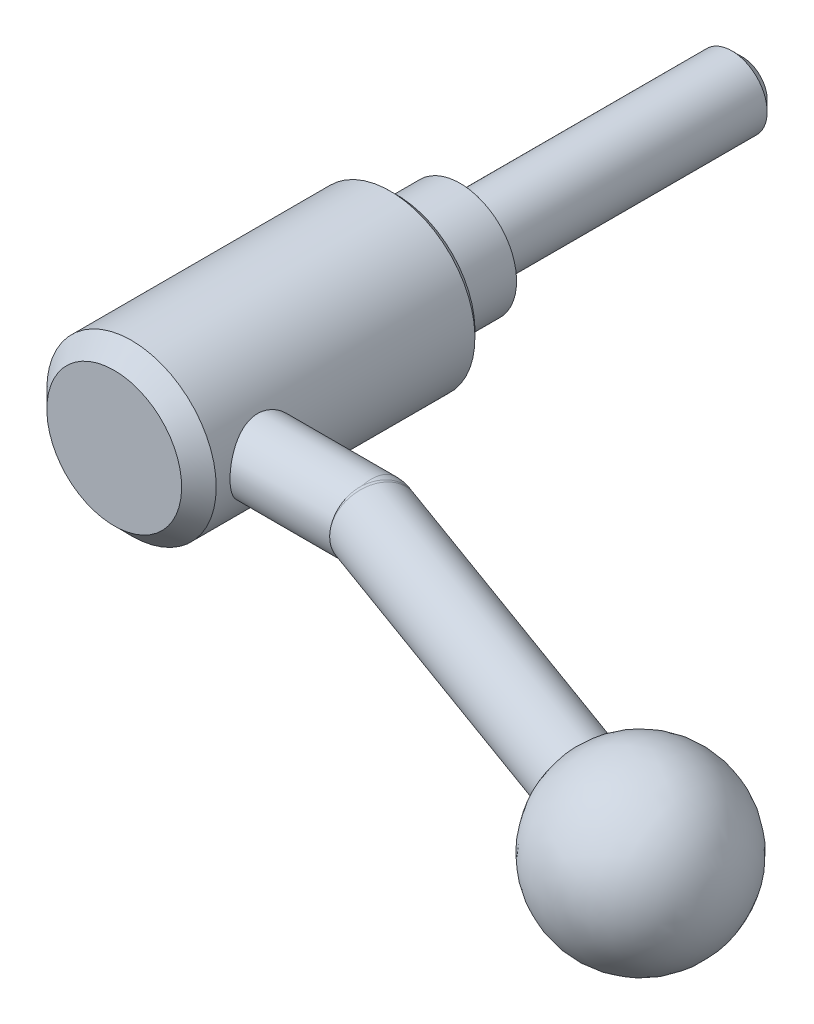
ISO-10303-21;
HEADER;
FILE_DESCRIPTION(('STEP AP214'),'2;1');
FILE_NAME('part.step','',(''),(''),'','','');
FILE_SCHEMA(('AUTOMOTIVE_DESIGN { 1 0 10303 214 1 1 1 1 }'));
ENDSEC;
DATA;
#1=APPLICATION_CONTEXT('core data for automotive mechanical design processes');
#2=APPLICATION_PROTOCOL_DEFINITION('international standard','automotive_design',2000,#1);
#3=PRODUCT_CONTEXT('',#1,'mechanical');
#4=PRODUCT('Part','Part','',(#3));
#5=PRODUCT_RELATED_PRODUCT_CATEGORY('part','',(#4));
#6=PRODUCT_DEFINITION_FORMATION('','',#4);
#7=PRODUCT_DEFINITION_CONTEXT('part definition',#1,'design');
#8=PRODUCT_DEFINITION('design','',#6,#7);
#9=PRODUCT_DEFINITION_SHAPE('','',#8);
#10=(LENGTH_UNIT() NAMED_UNIT(*) SI_UNIT(.MILLI.,.METRE.));
#11=(NAMED_UNIT(*) PLANE_ANGLE_UNIT() SI_UNIT($,.RADIAN.));
#12=(NAMED_UNIT(*) SI_UNIT($,.STERADIAN.) SOLID_ANGLE_UNIT());
#13=UNCERTAINTY_MEASURE_WITH_UNIT(LENGTH_MEASURE(1.E-05),#10,'distance_accuracy_value','');
#14=(GEOMETRIC_REPRESENTATION_CONTEXT(3) GLOBAL_UNCERTAINTY_ASSIGNED_CONTEXT((#13)) GLOBAL_UNIT_ASSIGNED_CONTEXT((#10,
#11,#12)) REPRESENTATION_CONTEXT('',''));
#15=CARTESIAN_POINT('',(0.,0.,0.));
#16=DIRECTION('',(0.,0.,1.));
#17=DIRECTION('',(1.,0.,0.));
#18=AXIS2_PLACEMENT_3D('',#15,#16,#17);
#19=CARTESIAN_POINT('',(6.,0.,0.));
#20=DIRECTION('',(0.,0.,-1.));
#21=DIRECTION('',(0.,1.,0.));
#22=AXIS2_PLACEMENT_3D('',#19,#20,#21);
#23=PLANE('',#22);
#24=CARTESIAN_POINT('',(0.,0.,0.));
#25=DIRECTION('',(0.,0.,1.));
#26=DIRECTION('',(0.,-1.,0.));
#27=AXIS2_PLACEMENT_3D('',#24,#25,#26);
#28=CIRCLE('',#27,8.);
#29=CARTESIAN_POINT('',(0.,-8.,0.));
#30=VERTEX_POINT('',#29);
#31=EDGE_CURVE('E244',#30,#30,#28,.T.);
#32=ORIENTED_EDGE('',*,*,#31,.F.);
#33=EDGE_LOOP('',(#32));
#34=FACE_BOUND('',#33,.T.);
#35=CARTESIAN_POINT('',(0.,0.,0.));
#36=DIRECTION('',(0.,0.,-1.));
#37=DIRECTION('',(-1.,0.,0.));
#38=AXIS2_PLACEMENT_3D('',#35,#36,#37);
#39=CIRCLE('',#38,5.);
#40=CARTESIAN_POINT('',(-5.,0.,0.));
#41=VERTEX_POINT('',#40);
#42=EDGE_CURVE('E248',#41,#41,#39,.T.);
#43=ORIENTED_EDGE('',*,*,#42,.F.);
#44=EDGE_LOOP('',(#43));
#45=FACE_BOUND('',#44,.T.);
#46=ADVANCED_FACE('F14',(#34,#45),#23,.T.);
#47=CARTESIAN_POINT('',(0.,0.,4.5));
#48=DIRECTION('',(0.,0.,1.));
#49=DIRECTION('',(0.,-1.,0.));
#50=AXIS2_PLACEMENT_3D('',#47,#48,#49);
#51=CYLINDRICAL_SURFACE('',#50,8.);
#52=CARTESIAN_POINT('',(0.,0.,9.));
#53=DIRECTION('',(0.,0.,1.));
#54=DIRECTION('',(0.,-1.,0.));
#55=AXIS2_PLACEMENT_3D('',#52,#53,#54);
#56=CIRCLE('',#55,8.);
#57=CARTESIAN_POINT('',(0.,-8.,9.));
#58=VERTEX_POINT('',#57);
#59=EDGE_CURVE('E247',#58,#58,#56,.T.);
#60=ORIENTED_EDGE('',*,*,#59,.F.);
#61=EDGE_LOOP('',(#60));
#62=FACE_BOUND('',#61,.T.);
#63=ORIENTED_EDGE('',*,*,#31,.T.);
#64=EDGE_LOOP('',(#63));
#65=FACE_BOUND('',#64,.T.);
#66=ADVANCED_FACE('F103',(#62,#65),#51,.T.);
#67=CARTESIAN_POINT('',(9.55,0.,9.));
#68=DIRECTION('',(0.,0.,-1.));
#69=DIRECTION('',(0.,1.,0.));
#70=AXIS2_PLACEMENT_3D('',#67,#68,#69);
#71=PLANE('',#70);
#72=ORIENTED_EDGE('',*,*,#59,.T.);
#73=EDGE_LOOP('',(#72));
#74=FACE_BOUND('',#73,.T.);
#75=CARTESIAN_POINT('',(0.,0.,9.));
#76=DIRECTION('',(0.,0.,1.));
#77=DIRECTION('',(0.,-1.,0.));
#78=AXIS2_PLACEMENT_3D('',#75,#76,#77);
#79=CIRCLE('',#78,11.1);
#80=CARTESIAN_POINT('',(0.,-11.1,9.));
#81=VERTEX_POINT('',#80);
#82=EDGE_CURVE('E251',#81,#81,#79,.T.);
#83=ORIENTED_EDGE('',*,*,#82,.F.);
#84=EDGE_LOOP('',(#83));
#85=FACE_BOUND('',#84,.T.);
#86=ADVANCED_FACE('F113',(#74,#85),#71,.T.);
#87=CARTESIAN_POINT('',(4.775,0.,49.));
#88=DIRECTION('',(0.,0.,1.));
#89=DIRECTION('',(0.,-1.,0.));
#90=AXIS2_PLACEMENT_3D('',#87,#88,#89);
#91=PLANE('',#90);
#92=CARTESIAN_POINT('',(0.,0.,49.));
#93=DIRECTION('',(0.,0.,-1.));
#94=DIRECTION('',(0.,1.,0.));
#95=AXIS2_PLACEMENT_3D('',#92,#93,#94);
#96=CIRCLE('',#95,9.55);
#97=CARTESIAN_POINT('',(0.,9.55,49.));
#98=VERTEX_POINT('',#97);
#99=EDGE_CURVE('E253',#98,#98,#96,.T.);
#100=ORIENTED_EDGE('',*,*,#99,.F.);
#101=EDGE_LOOP('',(#100));
#102=FACE_BOUND('',#101,.T.);
#103=ADVANCED_FACE('F122',(#102),#91,.T.);
#104=CARTESIAN_POINT('',(0.,0.,9.9));
#105=DIRECTION('',(0.,0.,1.));
#106=DIRECTION('',(0.,-1.,0.));
#107=AXIS2_PLACEMENT_3D('',#104,#105,#106);
#108=CONICAL_SURFACE('',#107,12.,0.785398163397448);
#109=ORIENTED_EDGE('',*,*,#82,.T.);
#110=EDGE_LOOP('',(#109));
#111=FACE_BOUND('',#110,.T.);
#112=CARTESIAN_POINT('',(0.,0.,9.9));
#113=DIRECTION('',(0.,0.,1.));
#114=DIRECTION('',(0.,-1.,0.));
#115=AXIS2_PLACEMENT_3D('',#112,#113,#114);
#116=CIRCLE('',#115,12.);
#117=CARTESIAN_POINT('',(0.,-12.,9.9));
#118=VERTEX_POINT('',#117);
#119=EDGE_CURVE('E255',#118,#118,#116,.T.);
#120=ORIENTED_EDGE('',*,*,#119,.F.);
#121=EDGE_LOOP('',(#120));
#122=FACE_BOUND('',#121,.T.);
#123=ADVANCED_FACE('F126',(#111,#122),#108,.T.);
#124=CARTESIAN_POINT('',(0.,0.,46.55));
#125=DIRECTION('',(0.,0.,-1.));
#126=DIRECTION('',(0.,1.,0.));
#127=AXIS2_PLACEMENT_3D('',#124,#125,#126);
#128=CONICAL_SURFACE('',#127,12.,0.785398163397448);
#129=CARTESIAN_POINT('',(0.,0.,46.55));
#130=DIRECTION('',(0.,0.,1.));
#131=DIRECTION('',(0.,-1.,0.));
#132=AXIS2_PLACEMENT_3D('',#129,#130,#131);
#133=CIRCLE('',#132,12.);
#134=CARTESIAN_POINT('',(0.,-12.,46.55));
#135=VERTEX_POINT('',#134);
#136=EDGE_CURVE('E47',#135,#135,#133,.F.);
#137=ORIENTED_EDGE('',*,*,#136,.F.);
#138=EDGE_LOOP('',(#137));
#139=FACE_BOUND('',#138,.T.);
#140=ORIENTED_EDGE('',*,*,#99,.T.);
#141=EDGE_LOOP('',(#140));
#142=FACE_BOUND('',#141,.T.);
#143=ADVANCED_FACE('F130',(#139,#142),#128,.T.);
#144=CARTESIAN_POINT('',(0.,0.,28.225));
#145=DIRECTION('',(0.,0.,1.));
#146=DIRECTION('',(0.,-1.,0.));
#147=AXIS2_PLACEMENT_3D('',#144,#145,#146);
#148=CYLINDRICAL_SURFACE('',#147,12.);
#149=ORIENTED_EDGE('',*,*,#119,.T.);
#150=EDGE_LOOP('',(#149));
#151=FACE_BOUND('',#150,.T.);
#152=ORIENTED_EDGE('',*,*,#136,.T.);
#153=EDGE_LOOP('',(#152));
#154=FACE_BOUND('',#153,.T.);
#155=CARTESIAN_POINT('',(10.9087121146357,-5.,39.6));
#156=CARTESIAN_POINT('',(10.9087074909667,-5.00000435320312,39.4663888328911));
#157=CARTESIAN_POINT('',(10.9111719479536,-4.9946421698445,39.332819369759));
#158=CARTESIAN_POINT('',(10.9209330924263,-4.97326581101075,39.0666742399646));
#159=CARTESIAN_POINT('',(10.9282304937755,-4.95725006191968,38.9340987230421));
#160=CARTESIAN_POINT('',(10.9474176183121,-4.91473148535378,38.6709152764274));
#161=CARTESIAN_POINT('',(10.9593097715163,-4.88822310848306,38.5403084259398));
#162=CARTESIAN_POINT('',(10.9872938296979,-4.82499419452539,38.2820015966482));
#163=CARTESIAN_POINT('',(11.0033874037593,-4.78826959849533,38.1543027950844));
#164=CARTESIAN_POINT('',(11.0391954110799,-4.7051251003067,37.9031731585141));
#165=CARTESIAN_POINT('',(11.0588958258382,-4.65874264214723,37.7797279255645));
#166=CARTESIAN_POINT('',(11.1013704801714,-4.55660310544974,37.5373089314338));
#167=CARTESIAN_POINT('',(11.1241458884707,-4.50084246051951,37.4183368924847));
#168=CARTESIAN_POINT('',(11.1961251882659,-4.32013829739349,37.0691963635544));
#169=CARTESIAN_POINT('',(11.2490137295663,-4.18170265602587,36.8465940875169));
#170=CARTESIAN_POINT('',(11.362232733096,-3.8638933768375,36.4146674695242));
#171=CARTESIAN_POINT('',(11.4228143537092,-3.68265681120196,36.2067915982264));
#172=CARTESIAN_POINT('',(11.5425745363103,-3.28806144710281,35.8231953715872));
#173=CARTESIAN_POINT('',(11.6017524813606,-3.07468881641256,35.6474889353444));
#174=CARTESIAN_POINT('',(11.6861286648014,-2.729351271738,35.4081642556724));
#175=CARTESIAN_POINT('',(11.7140590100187,-2.60716588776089,35.3310867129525));
#176=CARTESIAN_POINT('',(11.7671168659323,-2.35613739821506,35.1875758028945));
#177=CARTESIAN_POINT('',(11.7922454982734,-2.22729698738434,35.1211381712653));
#178=CARTESIAN_POINT('',(11.8389586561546,-1.96390692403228,34.9995551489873));
#179=CARTESIAN_POINT('',(11.8605461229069,-1.82936212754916,34.9444003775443));
#180=CARTESIAN_POINT('',(11.8995627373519,-1.55549044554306,34.8458826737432));
#181=CARTESIAN_POINT('',(11.9169929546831,-1.41616480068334,34.802516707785));
#182=CARTESIAN_POINT('',(11.9541941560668,-1.06793180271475,34.7106955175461));
#183=CARTESIAN_POINT('',(11.971276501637,-0.856830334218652,34.6692715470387));
#184=CARTESIAN_POINT('',(11.9941758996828,-0.430450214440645,34.6139291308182));
#185=CARTESIAN_POINT('',(11.9999946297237,-0.21517219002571,34.6000065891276));
#186=CARTESIAN_POINT('',(12.0000033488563,0.134179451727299,34.599995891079));
#187=CARTESIAN_POINT('',(11.9977460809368,0.268317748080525,34.6054032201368));
#188=CARTESIAN_POINT('',(11.9887853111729,0.535617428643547,34.6269647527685));
#189=CARTESIAN_POINT('',(11.9820811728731,0.668778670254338,34.6431204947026));
#190=CARTESIAN_POINT('',(11.9643973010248,0.933147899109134,34.6860218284));
#191=CARTESIAN_POINT('',(11.953415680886,1.06435499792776,34.7127720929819));
#192=CARTESIAN_POINT('',(11.9274624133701,1.32387896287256,34.7765977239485));
#193=CARTESIAN_POINT('',(11.9124892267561,1.45219469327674,34.8136770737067));
#194=CARTESIAN_POINT('',(11.8789883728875,1.70463818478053,34.8976767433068));
#195=CARTESIAN_POINT('',(11.8604718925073,1.82877771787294,34.9445661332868));
#196=CARTESIAN_POINT('',(11.8203169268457,2.07253499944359,35.0478413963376));
#197=CARTESIAN_POINT('',(11.798677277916,2.19215104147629,35.1042308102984));
#198=CARTESIAN_POINT('',(11.7298504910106,2.54307722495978,35.2869746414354));
#199=CARTESIAN_POINT('',(11.6787242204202,2.76669061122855,35.4269801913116));
#200=CARTESIAN_POINT('',(11.5683077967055,3.19783916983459,35.7465298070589));
#201=CARTESIAN_POINT('',(11.5087513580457,3.40417283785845,35.9275881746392));
#202=CARTESIAN_POINT('',(11.3892960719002,3.78466739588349,36.3211115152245));
#203=CARTESIAN_POINT('',(11.3293970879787,3.95881438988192,36.5335899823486));
#204=CARTESIAN_POINT('',(11.2426695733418,4.19642658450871,36.8777228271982));
#205=CARTESIAN_POINT('',(11.2136418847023,4.27318612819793,36.999855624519));
#206=CARTESIAN_POINT('',(11.1581434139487,4.41607290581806,37.2507224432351));
#207=CARTESIAN_POINT('',(11.1316715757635,4.48220453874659,37.3794537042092));
#208=CARTESIAN_POINT('',(11.0821579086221,4.60326626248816,37.6427214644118));
#209=CARTESIAN_POINT('',(11.0591162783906,4.65819570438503,37.7772582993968));
#210=CARTESIAN_POINT('',(11.017290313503,4.75627570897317,38.0511355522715));
#211=CARTESIAN_POINT('',(10.9985037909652,4.7994323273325,38.1904734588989));
#212=CARTESIAN_POINT('',(10.9666619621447,4.87173601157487,38.4661918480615));
#213=CARTESIAN_POINT('',(10.95337593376,4.90145335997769,38.6023961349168));
#214=CARTESIAN_POINT('',(10.9317788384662,4.94943495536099,38.8771389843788));
#215=CARTESIAN_POINT('',(10.9234654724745,4.96770449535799,39.0156764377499));
#216=CARTESIAN_POINT('',(10.9121183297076,4.99258064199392,39.2939753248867));
#217=CARTESIAN_POINT('',(10.9090831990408,4.9991902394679,39.4337364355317));
#218=CARTESIAN_POINT('',(10.9084052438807,5.00066966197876,39.7133300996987));
#219=CARTESIAN_POINT('',(10.9107621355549,4.99554010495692,39.8531626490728));
#220=CARTESIAN_POINT('',(10.9203897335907,4.97445537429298,40.1209853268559));
#221=CARTESIAN_POINT('',(10.9272683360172,4.9593636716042,40.249058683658));
#222=CARTESIAN_POINT('',(10.9453203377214,4.91939458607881,40.5034023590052));
#223=CARTESIAN_POINT('',(10.956495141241,4.89451400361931,40.6296720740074));
#224=CARTESIAN_POINT('',(10.9827914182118,4.83521904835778,40.879504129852));
#225=CARTESIAN_POINT('',(10.9979119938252,4.80080684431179,41.003067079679));
#226=CARTESIAN_POINT('',(11.0316484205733,4.72276748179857,41.2467742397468));
#227=CARTESIAN_POINT('',(11.0502656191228,4.67913677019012,41.366917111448));
#228=CARTESIAN_POINT('',(11.1114356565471,4.5329201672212,41.7260913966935));
#229=CARTESIAN_POINT('',(11.1587373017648,4.41622884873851,41.9587504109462));
#230=CARTESIAN_POINT('',(11.2607390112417,4.14922979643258,42.4019586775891));
#231=CARTESIAN_POINT('',(11.3154417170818,3.99891004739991,42.6124999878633));
#232=CARTESIAN_POINT('',(11.4317082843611,3.65402282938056,43.0243539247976));
#233=CARTESIAN_POINT('',(11.4934615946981,3.45679190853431,43.223388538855));
#234=CARTESIAN_POINT('',(11.6130178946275,3.03093539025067,43.586433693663));
#235=CARTESIAN_POINT('',(11.6708188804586,2.80229404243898,43.7504265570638));
#236=CARTESIAN_POINT('',(11.7505844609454,2.43719005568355,43.9681695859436));
#237=CARTESIAN_POINT('',(11.7762816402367,2.31013401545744,44.0366869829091));
#238=CARTESIAN_POINT('',(11.8243239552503,2.05007418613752,44.1626787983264));
#239=CARTESIAN_POINT('',(11.8466705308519,1.91707298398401,44.2201579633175));
#240=CARTESIAN_POINT('',(11.8873291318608,1.64624850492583,44.3234355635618));
#241=CARTESIAN_POINT('',(11.9056471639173,1.50843276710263,44.3692514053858));
#242=CARTESIAN_POINT('',(11.9377378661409,1.228899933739,44.4488050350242));
#243=CARTESIAN_POINT('',(11.9515124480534,1.08718450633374,44.4825479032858));
#244=CARTESIAN_POINT('',(11.9750487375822,0.788932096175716,44.5398925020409));
#245=CARTESIAN_POINT('',(11.9843764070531,0.63214971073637,44.5624048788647));
#246=CARTESIAN_POINT('',(11.9968515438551,0.316905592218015,44.5924579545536));
#247=CARTESIAN_POINT('',(11.9999991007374,0.158443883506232,44.5999988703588));
#248=CARTESIAN_POINT('',(12.0000007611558,-0.134110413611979,44.6000009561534));
#249=CARTESIAN_POINT('',(11.9977471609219,-0.268208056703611,44.5946001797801));
#250=CARTESIAN_POINT('',(11.9887940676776,-0.535433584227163,44.5730555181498));
#251=CARTESIAN_POINT('',(11.9820932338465,-0.668561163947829,44.5569083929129));
#252=CARTESIAN_POINT('',(11.9644136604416,-0.932940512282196,44.5140182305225));
#253=CARTESIAN_POINT('',(11.9534307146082,-1.06419030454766,44.4872647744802));
#254=CARTESIAN_POINT('',(11.9274719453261,-1.32379800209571,44.4234258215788));
#255=CARTESIAN_POINT('',(11.9124945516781,-1.45215474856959,44.3863362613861));
#256=CARTESIAN_POINT('',(11.8789871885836,-1.70464692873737,44.3023203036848));
#257=CARTESIAN_POINT('',(11.8604692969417,-1.82879507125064,44.2554272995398));
#258=CARTESIAN_POINT('',(11.8203109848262,-2.07256946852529,44.1521432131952));
#259=CARTESIAN_POINT('',(11.798669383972,-2.19219399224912,44.0957485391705));
#260=CARTESIAN_POINT('',(11.7298430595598,-2.5431097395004,43.9130050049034));
#261=CARTESIAN_POINT('',(11.678720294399,-2.76670593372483,43.7730084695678));
#262=CARTESIAN_POINT('',(11.5683124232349,-3.19782111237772,43.4534835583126));
#263=CARTESIAN_POINT('',(11.5087611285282,-3.40413902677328,43.2724414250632));
#264=CARTESIAN_POINT('',(11.3893058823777,-3.78463884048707,42.8789233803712));
#265=CARTESIAN_POINT('',(11.3294017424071,-3.95880157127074,42.6664288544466));
#266=CARTESIAN_POINT('',(11.2426570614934,-4.19646089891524,42.3222273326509));
#267=CARTESIAN_POINT('',(11.2136175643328,-4.27325053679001,42.2000414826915));
#268=CARTESIAN_POINT('',(11.1580975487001,-4.41618919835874,41.9490631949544));
#269=CARTESIAN_POINT('',(11.1316160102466,-4.48234247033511,41.8202734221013));
#270=CARTESIAN_POINT('',(11.0821110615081,-4.60337872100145,41.557006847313));
#271=CARTESIAN_POINT('',(11.059084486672,-4.65827203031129,41.4225353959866));
#272=CARTESIAN_POINT('',(11.0172786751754,-4.75630122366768,41.1487863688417));
#273=CARTESIAN_POINT('',(10.9984982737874,-4.79944033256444,41.0095101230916));
#274=CARTESIAN_POINT('',(10.9584249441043,-4.89044651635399,40.6624381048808));
#275=CARTESIAN_POINT('',(10.9399177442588,-4.93143703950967,40.4524635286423));
#276=CARTESIAN_POINT('',(10.9150663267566,-4.98620740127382,40.028289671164));
#277=CARTESIAN_POINT('',(10.9087195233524,-4.9999930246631,39.8140912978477));
#278=CARTESIAN_POINT('',(10.9087121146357,-5.,39.6));
#279=B_SPLINE_CURVE_WITH_KNOTS('',3,(#155,#156,#157,#158,#159,#160,#161,#162,#163,#164,#165,
#166,#167,#168,#169,#170,#171,#172,#173,#174,#175,#176,#177,#178,#179,#180,#181,#182,#183,#184,
#185,#186,#187,#188,#189,#190,#191,#192,#193,#194,#195,#196,#197,#198,#199,#200,#201,#202,#203,
#204,#205,#206,#207,#208,#209,#210,#211,#212,#213,#214,#215,#216,#217,#218,#219,#220,#221,#222,
#223,#224,#225,#226,#227,#228,#229,#230,#231,#232,#233,#234,#235,#236,#237,#238,#239,#240,#241,
#242,#243,#244,#245,#246,#247,#248,#249,#250,#251,#252,#253,#254,#255,#256,#257,#258,#259,#260,
#261,#262,#263,#264,#265,#266,#267,#268,#269,#270,#271,#272,#273,#274,#275,#276,#277,#278),
.UNSPECIFIED.,.T.,.F.,(4,2,2,2,2,2,2,2,2,2,2,2,2,2,2,2,2,2,2,2,2,2,2,2,2,2,2,2,2,2,2,2,2,2,2,2,
2,2,2,2,2,2,2,2,2,2,2,2,2,2,2,2,2,2,2,2,2,2,2,2,2,4),(0.,0.400632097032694,0.801323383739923,
1.20222687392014,1.60328987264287,2.00282595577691,2.4025143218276,3.20122978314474,
4.04481584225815,4.88876604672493,5.32972022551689,5.77049723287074,6.21090626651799,
6.65120186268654,7.29649650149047,7.94169502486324,8.34403504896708,8.74643267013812,
9.14900797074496,9.55173873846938,9.95321838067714,10.3548479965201,11.1573969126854,
11.9966160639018,12.8361966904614,13.2771668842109,13.7179540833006,14.1587668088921,
14.5993523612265,15.0189121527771,15.4382778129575,15.8575358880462,16.2767718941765,
16.6637453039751,17.0508453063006,17.4378573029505,17.8250187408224,18.6150346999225,
19.4053333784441,20.2623217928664,21.1197415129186,21.5591319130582,21.9983329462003,
22.4368746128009,22.875231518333,23.3503940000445,23.8255495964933,24.2277318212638,
24.6300353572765,25.0327350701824,25.4355933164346,25.837101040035,26.2387608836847,
27.041251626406,27.880402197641,28.7200514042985,29.161206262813,29.6021844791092,
30.042756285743,30.4832070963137,31.1252948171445,31.767245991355),.UNSPECIFIED.);
#280=CARTESIAN_POINT('',(10.9087121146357,-5.,39.6));
#281=VERTEX_POINT('',#280);
#282=EDGE_CURVE('E46',#281,#281,#279,.T.);
#283=ORIENTED_EDGE('',*,*,#282,.F.);
#284=EDGE_LOOP('',(#283));
#285=FACE_BOUND('',#284,.T.);
#286=ADVANCED_FACE('F133',(#151,#154,#285),#148,.T.);
#287=CARTESIAN_POINT('',(27.,0.,39.6));
#288=DIRECTION('',(1.,0.,0.));
#289=DIRECTION('',(0.,0.,1.));
#290=AXIS2_PLACEMENT_3D('',#287,#288,#289);
#291=SPHERICAL_SURFACE('',#290,5.);
#292=CARTESIAN_POINT('',(27.,0.,39.6));
#293=DIRECTION('',(-1.,0.,0.));
#294=DIRECTION('',(0.,-1.,0.));
#295=AXIS2_PLACEMENT_3D('',#292,#293,#294);
#296=CIRCLE('',#295,5.);
#297=CARTESIAN_POINT('',(27.,4.83102779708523,40.8888640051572));
#298=VERTEX_POINT('',#297);
#299=CARTESIAN_POINT('',(27.,-4.83102779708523,40.8888640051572));
#300=VERTEX_POINT('',#299);
#301=EDGE_CURVE('E35',#298,#300,#296,.T.);
#302=ORIENTED_EDGE('',*,*,#301,.F.);
#303=CARTESIAN_POINT('',(27.,-4.83102779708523,40.8888640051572));
#304=CARTESIAN_POINT('',(27.046470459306,-4.86510599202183,40.7611874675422));
#305=CARTESIAN_POINT('',(27.0934341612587,-4.89342279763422,40.632155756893));
#306=CARTESIAN_POINT('',(27.1880079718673,-4.93839650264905,40.3723163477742));
#307=CARTESIAN_POINT('',(27.2356180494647,-4.95505396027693,40.241508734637));
#308=CARTESIAN_POINT('',(27.331115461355,-4.97656756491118,39.979131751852));
#309=CARTESIAN_POINT('',(27.379002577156,-4.98143200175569,39.8475629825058));
#310=CARTESIAN_POINT('',(27.4747462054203,-4.9793538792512,39.5845095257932));
#311=CARTESIAN_POINT('',(27.5226027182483,-4.97241146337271,39.4530248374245));
#312=CARTESIAN_POINT('',(27.6179594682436,-4.94676429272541,39.19103432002));
#313=CARTESIAN_POINT('',(27.665459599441,-4.92805616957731,39.0605287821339));
#314=CARTESIAN_POINT('',(27.7597694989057,-4.87899874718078,38.8014144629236));
#315=CARTESIAN_POINT('',(27.8065790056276,-4.8486451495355,38.6728064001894));
#316=CARTESIAN_POINT('',(27.8991305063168,-4.77653351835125,38.4185232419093));
#317=CARTESIAN_POINT('',(27.9448730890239,-4.73478194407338,38.2928465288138));
#318=CARTESIAN_POINT('',(28.0350097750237,-4.64014604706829,38.0451980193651));
#319=CARTESIAN_POINT('',(28.0794033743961,-4.58725762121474,37.9232276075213));
#320=CARTESIAN_POINT('',(28.1664936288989,-4.47075360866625,37.6839490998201));
#321=CARTESIAN_POINT('',(28.2091908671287,-4.40714174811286,37.5666394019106));
#322=CARTESIAN_POINT('',(28.2926167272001,-4.26960465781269,37.3374287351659));
#323=CARTESIAN_POINT('',(28.3333446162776,-4.19567562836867,37.2255297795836));
#324=CARTESIAN_POINT('',(28.412516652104,-4.03806489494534,37.0080063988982));
#325=CARTESIAN_POINT('',(28.4509612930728,-3.95438531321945,36.9023806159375));
#326=CARTESIAN_POINT('',(28.5253169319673,-3.77782268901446,36.6980901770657));
#327=CARTESIAN_POINT('',(28.5612269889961,-3.6849362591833,36.5994281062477));
#328=CARTESIAN_POINT('',(28.6302280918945,-3.49068679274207,36.4098491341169));
#329=CARTESIAN_POINT('',(28.6633202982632,-3.38932728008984,36.3189290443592));
#330=CARTESIAN_POINT('',(28.7264788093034,-3.1787799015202,36.1454024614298));
#331=CARTESIAN_POINT('',(28.7565439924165,-3.06958915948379,36.0627990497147));
#332=CARTESIAN_POINT('',(28.8134084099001,-2.84423774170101,35.9065653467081));
#333=CARTESIAN_POINT('',(28.8402090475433,-2.72808009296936,35.8329311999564));
#334=CARTESIAN_POINT('',(28.8903782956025,-2.48953382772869,35.6950923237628));
#335=CARTESIAN_POINT('',(28.9137456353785,-2.367142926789,35.6308910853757));
#336=CARTESIAN_POINT('',(28.9568627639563,-2.11708267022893,35.5124277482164));
#337=CARTESIAN_POINT('',(28.9766138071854,-1.98941516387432,35.4581622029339));
#338=CARTESIAN_POINT('',(29.0123746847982,-1.7296246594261,35.3599099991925));
#339=CARTESIAN_POINT('',(29.0283831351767,-1.59750003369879,35.3159271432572));
#340=CARTESIAN_POINT('',(29.0565303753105,-1.32981336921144,35.2385932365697));
#341=CARTESIAN_POINT('',(29.0686705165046,-1.1942525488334,35.20523847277));
#342=CARTESIAN_POINT('',(29.0890073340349,-0.920611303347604,35.1493635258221));
#343=CARTESIAN_POINT('',(29.0972025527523,-0.782529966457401,35.1268473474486));
#344=CARTESIAN_POINT('',(29.1157561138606,-0.36607670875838,35.075871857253));
#345=CARTESIAN_POINT('',(29.1201131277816,-0.0852019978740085,35.0639010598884));
#346=CARTESIAN_POINT('',(29.1126324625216,0.474546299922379,35.0844540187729));
#347=CARTESIAN_POINT('',(29.1007947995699,0.753419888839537,35.1169777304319));
#348=CARTESIAN_POINT('',(29.0612756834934,1.30144109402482,35.2255556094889));
#349=CARTESIAN_POINT('',(29.0335941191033,1.57058864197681,35.3016100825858));
#350=CARTESIAN_POINT('',(28.9631693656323,2.09146114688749,35.495100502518));
#351=CARTESIAN_POINT('',(28.9204263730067,2.34318633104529,35.6125359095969));
#352=CARTESIAN_POINT('',(28.8210936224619,2.82208357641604,35.885450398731));
#353=CARTESIAN_POINT('',(28.764504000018,3.04925587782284,36.0409291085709));
#354=CARTESIAN_POINT('',(28.6390816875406,3.47260490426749,36.3855240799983));
#355=CARTESIAN_POINT('',(28.5702485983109,3.66878061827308,36.5746414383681));
#356=CARTESIAN_POINT('',(28.4222952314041,4.02455922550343,36.9811399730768));
#357=CARTESIAN_POINT('',(28.3431749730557,4.18416218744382,37.1985210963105));
#358=CARTESIAN_POINT('',(28.1768942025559,4.46226027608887,37.6553737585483));
#359=CARTESIAN_POINT('',(28.0897339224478,4.58075658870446,37.8948446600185));
#360=CARTESIAN_POINT('',(27.9098378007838,4.77329945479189,38.3891051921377));
#361=CARTESIAN_POINT('',(27.8171011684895,4.84733968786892,38.6438969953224));
#362=CARTESIAN_POINT('',(27.6287009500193,4.94882287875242,39.1615223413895));
#363=CARTESIAN_POINT('',(27.5330381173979,4.97627773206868,39.4243538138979));
#364=CARTESIAN_POINT('',(27.3636614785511,4.98299294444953,39.8897123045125));
#365=CARTESIAN_POINT('',(27.2899803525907,4.97191840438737,40.0921495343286));
#366=CARTESIAN_POINT('',(27.1803577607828,4.93453780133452,40.393335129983));
#367=CARTESIAN_POINT('',(27.1439766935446,4.91862341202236,40.4932912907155));
#368=CARTESIAN_POINT('',(27.0716363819,4.87994547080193,40.6920446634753));
#369=CARTESIAN_POINT('',(27.035677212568,4.8571807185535,40.7908416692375));
#370=CARTESIAN_POINT('',(27.,4.83102779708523,40.8888640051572));
#371=B_SPLINE_CURVE_WITH_KNOTS('',3,(#303,#304,#305,#306,#307,#308,#309,#310,#311,#312,#313,
#314,#315,#316,#317,#318,#319,#320,#321,#322,#323,#324,#325,#326,#327,#328,#329,#330,#331,#332,
#333,#334,#335,#336,#337,#338,#339,#340,#341,#342,#343,#344,#345,#346,#347,#348,#349,#350,#351,
#352,#353,#354,#355,#356,#357,#358,#359,#360,#361,#362,#363,#364,#365,#366,#367,#368,#369,#370),
.UNSPECIFIED.,.F.,.F.,(4,2,2,2,2,2,2,2,2,2,2,2,2,2,2,2,2,2,2,2,2,2,2,2,2,2,2,2,2,2,2,2,2,4),(0.,
0.420108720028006,0.840197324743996,1.25999054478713,1.67977866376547,2.09968701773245,
2.51975051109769,2.93957644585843,3.35955732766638,3.77939257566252,4.19938285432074,
4.61928189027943,5.03933599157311,5.4592162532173,5.87925151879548,6.29910558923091,
6.71911465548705,7.13897775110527,7.5589958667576,7.9788670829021,8.39889331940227,
9.23803635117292,10.0771785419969,10.9163266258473,11.7554637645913,12.5945926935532,
13.4337489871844,14.2729037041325,15.1120342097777,15.9512839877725,16.7903194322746,
17.4356040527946,17.7580678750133,18.0805882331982),.UNSPECIFIED.);
#372=EDGE_CURVE('E49',#300,#298,#371,.T.);
#373=ORIENTED_EDGE('',*,*,#372,.F.);
#374=EDGE_LOOP('',(#302,#373));
#375=FACE_BOUND('',#374,.T.);
#376=ADVANCED_FACE('F50',(#375),#291,.T.);
#377=CARTESIAN_POINT('',(13.5,0.,39.6));
#378=DIRECTION('',(-1.,0.,0.));
#379=DIRECTION('',(0.,-1.,0.));
#380=AXIS2_PLACEMENT_3D('',#377,#378,#379);
#381=CYLINDRICAL_SURFACE('',#380,5.);
#382=CARTESIAN_POINT('',(26.1183650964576,0.,44.6));
#383=CARTESIAN_POINT('',(26.1183663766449,-0.138781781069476,44.6000146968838));
#384=CARTESIAN_POINT('',(26.1193840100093,-0.277557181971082,44.5942220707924));
#385=CARTESIAN_POINT('',(26.1234602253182,-0.554109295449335,44.571134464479));
#386=CARTESIAN_POINT('',(26.1265186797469,-0.691886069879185,44.5538402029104));
#387=CARTESIAN_POINT('',(26.134682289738,-0.965389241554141,44.5078755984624));
#388=CARTESIAN_POINT('',(26.1397861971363,-1.10111683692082,44.4792121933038));
#389=CARTESIAN_POINT('',(26.1520544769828,-1.36960411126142,44.4107588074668));
#390=CARTESIAN_POINT('',(26.159218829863,-1.50236381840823,44.3709689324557));
#391=CARTESIAN_POINT('',(26.1838439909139,-1.89485404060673,44.2353009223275));
#392=CARTESIAN_POINT('',(26.2044413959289,-2.14895022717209,44.1230982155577));
#393=CARTESIAN_POINT('',(26.2542951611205,-2.63434856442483,43.8587041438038));
#394=CARTESIAN_POINT('',(26.283548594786,-2.86565838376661,43.7065262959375));
#395=CARTESIAN_POINT('',(26.3343916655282,-3.19109256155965,43.4517642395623));
#396=CARTESIAN_POINT('',(26.3525481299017,-3.29619219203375,43.362198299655));
#397=CARTESIAN_POINT('',(26.3913190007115,-3.49841986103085,43.1749160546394));
#398=CARTESIAN_POINT('',(26.4119334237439,-3.59554784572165,43.0771996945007));
#399=CARTESIAN_POINT('',(26.4557847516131,-3.78117775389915,42.8743867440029));
#400=CARTESIAN_POINT('',(26.4790225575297,-3.86967669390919,42.7692876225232));
#401=CARTESIAN_POINT('',(26.5283452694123,-4.0374486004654,42.5525886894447));
#402=CARTESIAN_POINT('',(26.5544301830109,-4.11672154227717,42.4409888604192));
#403=CARTESIAN_POINT('',(26.6091879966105,-4.26396916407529,42.2146533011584));
#404=CARTESIAN_POINT('',(26.6377946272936,-4.33214705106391,42.1000335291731));
#405=CARTESIAN_POINT('',(26.6984986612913,-4.45880346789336,41.8664315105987));
#406=CARTESIAN_POINT('',(26.730595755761,-4.51728285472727,41.7474496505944));
#407=CARTESIAN_POINT('',(26.7818810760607,-4.59750472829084,41.5665481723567));
#408=CARTESIAN_POINT('',(26.7995055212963,-4.6230026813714,41.5058233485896));
#409=CARTESIAN_POINT('',(26.8359327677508,-4.67147271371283,41.3837195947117));
#410=CARTESIAN_POINT('',(26.8547355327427,-4.69444487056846,41.3223406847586));
#411=CARTESIAN_POINT('',(26.893680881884,-4.73784744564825,41.1990839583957));
#412=CARTESIAN_POINT('',(26.9138239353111,-4.75827696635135,41.1372059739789));
#413=CARTESIAN_POINT('',(26.9556781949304,-4.7965760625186,41.0131810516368));
#414=CARTESIAN_POINT('',(26.9773895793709,-4.81444534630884,40.9510340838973));
#415=CARTESIAN_POINT('',(27.,-4.83102779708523,40.8888640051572));
#416=B_SPLINE_CURVE_WITH_KNOTS('',3,(#382,#383,#384,#385,#386,#387,#388,#389,#390,#391,#392,
#393,#394,#395,#396,#397,#398,#399,#400,#401,#402,#403,#404,#405,#406,#407,#408,#409,#410,#411,
#412,#413,#414,#415),.UNSPECIFIED.,.F.,.F.,(4,2,2,2,2,2,2,2,2,2,2,2,2,2,2,2,4),(0.,
0.416209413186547,0.832392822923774,1.24832265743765,1.66424854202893,2.4956357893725,
3.32674227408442,3.74416003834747,4.16158062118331,4.57914501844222,4.99671053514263,
5.40545981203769,5.81417295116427,6.01865864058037,6.22313804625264,6.427689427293,
6.63226409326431),.UNSPECIFIED.);
#417=CARTESIAN_POINT('',(26.1183650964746,0.,44.6));
#418=VERTEX_POINT('',#417);
#419=EDGE_CURVE('E42',#418,#300,#416,.T.);
#420=ORIENTED_EDGE('',*,*,#419,.F.);
#421=CARTESIAN_POINT('',(27.,4.83102779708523,40.8888640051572));
#422=CARTESIAN_POINT('',(26.9769275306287,4.81410598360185,40.9523072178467));
#423=CARTESIAN_POINT('',(26.9547902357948,4.7958439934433,41.0157257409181));
#424=CARTESIAN_POINT('',(26.9121439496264,4.75665385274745,41.1422777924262));
#425=CARTESIAN_POINT('',(26.8916347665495,4.73572601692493,41.2054113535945));
#426=CARTESIAN_POINT('',(26.8520041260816,4.69122201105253,41.331151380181));
#427=CARTESIAN_POINT('',(26.8328821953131,4.66764675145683,41.3937580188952));
#428=CARTESIAN_POINT('',(26.7958563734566,4.6178676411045,41.5182794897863));
#429=CARTESIAN_POINT('',(26.7779525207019,4.59166370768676,41.5801943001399));
#430=CARTESIAN_POINT('',(26.7258878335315,4.5091853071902,41.7645681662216));
#431=CARTESIAN_POINT('',(26.6933404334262,4.44900605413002,41.8857648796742));
#432=CARTESIAN_POINT('',(26.6318437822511,4.3185755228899,42.1235503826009));
#433=CARTESIAN_POINT('',(26.6028947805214,4.24832354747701,42.2401388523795));
#434=CARTESIAN_POINT('',(26.5481524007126,4.0982165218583,42.4676074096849));
#435=CARTESIAN_POINT('',(26.5223565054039,4.01836923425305,42.5784920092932));
#436=CARTESIAN_POINT('',(26.4735791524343,3.84952818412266,42.7937191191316));
#437=CARTESIAN_POINT('',(26.4505976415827,3.76053459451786,42.8980617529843));
#438=CARTESIAN_POINT('',(26.4072342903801,3.57400503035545,43.099329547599));
#439=CARTESIAN_POINT('',(26.3868516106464,3.47647183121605,43.196257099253));
#440=CARTESIAN_POINT('',(26.3485188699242,3.27348573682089,43.3819590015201));
#441=CARTESIAN_POINT('',(26.3305688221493,3.16803279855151,43.4707333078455));
#442=CARTESIAN_POINT('',(26.2968121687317,2.94879128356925,43.6403010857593));
#443=CARTESIAN_POINT('',(26.281029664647,2.83492774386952,43.7210024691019));
#444=CARTESIAN_POINT('',(26.2517361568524,2.60058879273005,43.8727547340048));
#445=CARTESIAN_POINT('',(26.2382262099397,2.4801103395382,43.9438011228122));
#446=CARTESIAN_POINT('',(26.2134181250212,2.23340315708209,44.0756541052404));
#447=CARTESIAN_POINT('',(26.2021207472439,2.10717246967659,44.1364571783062));
#448=CARTESIAN_POINT('',(26.1817011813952,1.84996420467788,44.2472822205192));
#449=CARTESIAN_POINT('',(26.1725779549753,1.71898892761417,44.2973093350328));
#450=CARTESIAN_POINT('',(26.1567996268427,1.45869046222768,44.3843776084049));
#451=CARTESIAN_POINT('',(26.1500579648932,1.32952345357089,44.4218707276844));
#452=CARTESIAN_POINT('',(26.1385146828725,1.06850893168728,44.4863443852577));
#453=CARTESIAN_POINT('',(26.1337130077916,0.936661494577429,44.5133252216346));
#454=CARTESIAN_POINT('',(26.1260342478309,0.671136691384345,44.5565777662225));
#455=CARTESIAN_POINT('',(26.1231575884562,0.537458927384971,44.5728471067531));
#456=CARTESIAN_POINT('',(26.1193234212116,0.269188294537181,44.5945658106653));
#457=CARTESIAN_POINT('',(26.1183660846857,0.134595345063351,44.6000142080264));
#458=CARTESIAN_POINT('',(26.1183650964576,0.,44.6));
#459=B_SPLINE_CURVE_WITH_KNOTS('',3,(#421,#422,#423,#424,#425,#426,#427,#428,#429,#430,#431,
#432,#433,#434,#435,#436,#437,#438,#439,#440,#441,#442,#443,#444,#445,#446,#447,#448,#449,#450,
#451,#452,#453,#454,#455,#456,#457,#458),.UNSPECIFIED.,.F.,.F.,(4,2,2,2,2,2,2,2,2,2,2,2,2,2,2,2,
2,2,4),(0.,0.20876166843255,0.417498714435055,0.626164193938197,0.834836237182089,
1.25182287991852,1.66883840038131,2.08551879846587,2.50219132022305,2.91872892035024,
3.33526878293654,3.75611885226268,4.1771640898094,4.59835374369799,5.01934183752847,
5.42289691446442,5.82644054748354,6.23007335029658,6.63374218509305),.UNSPECIFIED.);
#460=EDGE_CURVE('E44',#298,#418,#459,.T.);
#461=ORIENTED_EDGE('',*,*,#460,.F.);
#462=ORIENTED_EDGE('',*,*,#301,.T.);
#463=EDGE_LOOP('',(#420,#461,#462));
#464=FACE_BOUND('',#463,.T.);
#465=ORIENTED_EDGE('',*,*,#282,.T.);
#466=EDGE_LOOP('',(#465));
#467=FACE_BOUND('',#466,.T.);
#468=ADVANCED_FACE('F39',(#464,#467),#381,.T.);
#469=CARTESIAN_POINT('',(27.828465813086,0.,39.9015368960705));
#470=DIRECTION('',(1.,0.,0.));
#471=DIRECTION('',(0.,0.,1.));
#472=AXIS2_PLACEMENT_3D('',#469,#470,#471);
#473=SPHERICAL_SURFACE('',#472,5.);
#474=ORIENTED_EDGE('',*,*,#372,.T.);
#475=ORIENTED_EDGE('',*,*,#460,.T.);
#476=CARTESIAN_POINT('',(27.8284658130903,0.,39.9015368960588));
#477=DIRECTION('',(-0.939692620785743,0.,-0.342020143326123));
#478=DIRECTION('',(0.342020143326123,0.,-0.939692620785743));
#479=AXIS2_PLACEMENT_3D('',#476,#477,#478);
#480=CIRCLE('',#479,5.);
#481=EDGE_CURVE('E55',#418,#418,#480,.F.);
#482=ORIENTED_EDGE('',*,*,#481,.F.);
#483=ORIENTED_EDGE('',*,*,#419,.T.);
#484=EDGE_LOOP('',(#474,#475,#482,#483));
#485=FACE_BOUND('',#484,.T.);
#486=ADVANCED_FACE('F54',(#485),#473,.T.);
#487=CARTESIAN_POINT('',(52.0314672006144,0.,48.7107089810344));
#488=DIRECTION('',(-0.939692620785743,0.,-0.342020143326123));
#489=DIRECTION('',(0.342020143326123,0.,-0.939692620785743));
#490=AXIS2_PLACEMENT_3D('',#487,#488,#489);
#491=CYLINDRICAL_SURFACE('',#490,5.);
#492=ORIENTED_EDGE('',*,*,#481,.T.);
#493=EDGE_LOOP('',(#492));
#494=FACE_BOUND('',#493,.T.);
#495=CARTESIAN_POINT('',(76.2344685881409,0.,57.5198810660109));
#496=DIRECTION('',(-0.939692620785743,0.,-0.342020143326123));
#497=DIRECTION('',(0.342020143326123,0.,-0.939692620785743));
#498=AXIS2_PLACEMENT_3D('',#495,#496,#497);
#499=CIRCLE('',#498,5.);
#500=CARTESIAN_POINT('',(77.9445693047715,0.,52.8214179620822));
#501=VERTEX_POINT('',#500);
#502=EDGE_CURVE('E240',#501,#501,#499,.F.);
#503=ORIENTED_EDGE('',*,*,#502,.F.);
#504=EDGE_LOOP('',(#503));
#505=FACE_BOUND('',#504,.T.);
#506=ADVANCED_FACE('F81',(#494,#505),#491,.T.);
#507=CARTESIAN_POINT('',(87.,0.,61.4382140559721));
#508=DIRECTION('',(1.,0.,0.));
#509=DIRECTION('',(0.,0.,1.));
#510=AXIS2_PLACEMENT_3D('',#507,#508,#509);
#511=SPHERICAL_SURFACE('',#510,12.5);
#512=CARTESIAN_POINT('',(99.5,0.,61.4382140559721));
#513=VERTEX_POINT('',#512);
#514=VERTEX_LOOP('',#513);
#515=FACE_BOUND('',#514,.T.);
#516=ORIENTED_EDGE('',*,*,#502,.T.);
#517=EDGE_LOOP('',(#516));
#518=FACE_BOUND('',#517,.T.);
#519=ADVANCED_FACE('F91',(#515,#518),#511,.T.);
#520=CARTESIAN_POINT('',(0.,0.,-40.));
#521=DIRECTION('',(0.,0.,1.));
#522=DIRECTION('',(1.,0.,0.));
#523=AXIS2_PLACEMENT_3D('',#520,#521,#522);
#524=CYLINDRICAL_SURFACE('',#523,5.);
#525=CARTESIAN_POINT('',(0.,0.,-38.5));
#526=DIRECTION('',(0.,0.,-1.));
#527=DIRECTION('',(-1.,0.,0.));
#528=AXIS2_PLACEMENT_3D('',#525,#526,#527);
#529=CIRCLE('',#528,5.);
#530=CARTESIAN_POINT('',(-5.,0.,-38.5));
#531=VERTEX_POINT('',#530);
#532=EDGE_CURVE('E9',#531,#531,#529,.F.);
#533=ORIENTED_EDGE('',*,*,#532,.T.);
#534=EDGE_LOOP('',(#533));
#535=FACE_BOUND('',#534,.T.);
#536=ORIENTED_EDGE('',*,*,#42,.T.);
#537=EDGE_LOOP('',(#536));
#538=FACE_BOUND('',#537,.T.);
#539=ADVANCED_FACE('F93',(#535,#538),#524,.T.);
#540=CARTESIAN_POINT('',(1.616603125,0.,-40.));
#541=DIRECTION('',(0.,0.,-1.));
#542=DIRECTION('',(0.,1.,0.));
#543=AXIS2_PLACEMENT_3D('',#540,#541,#542);
#544=PLANE('',#543);
#545=CARTESIAN_POINT('',(0.,0.,-40.));
#546=DIRECTION('',(0.,0.,-1.));
#547=DIRECTION('',(-1.,0.,0.));
#548=AXIS2_PLACEMENT_3D('',#545,#546,#547);
#549=CIRCLE('',#548,3.5);
#550=CARTESIAN_POINT('',(-3.5,0.,-40.));
#551=VERTEX_POINT('',#550);
#552=EDGE_CURVE('E23',#551,#551,#549,.T.);
#553=ORIENTED_EDGE('',*,*,#552,.T.);
#554=EDGE_LOOP('',(#553));
#555=FACE_BOUND('',#554,.T.);
#556=ADVANCED_FACE('F100',(#555),#544,.T.);
#557=CARTESIAN_POINT('',(0.,0.,-40.));
#558=DIRECTION('',(0.,0.,1.));
#559=DIRECTION('',(1.,0.,0.));
#560=AXIS2_PLACEMENT_3D('',#557,#558,#559);
#561=CONICAL_SURFACE('',#560,3.5,0.785398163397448);
#562=ORIENTED_EDGE('',*,*,#532,.F.);
#563=EDGE_LOOP('',(#562));
#564=FACE_BOUND('',#563,.T.);
#565=ORIENTED_EDGE('',*,*,#552,.F.);
#566=EDGE_LOOP('',(#565));
#567=FACE_BOUND('',#566,.T.);
#568=ADVANCED_FACE('F16',(#564,#567),#561,.T.);
#569=CLOSED_SHELL('',(#46,#66,#86,#103,#123,#143,#286,#376,#468,#486,#506,#519,#539,#556,#568));
#570=MANIFOLD_SOLID_BREP('B1',#569);
#571=ADVANCED_BREP_SHAPE_REPRESENTATION('',(#18,#570),#14);
#572=SHAPE_DEFINITION_REPRESENTATION(#9,#571);
ENDSEC;
END-ISO-10303-21;
